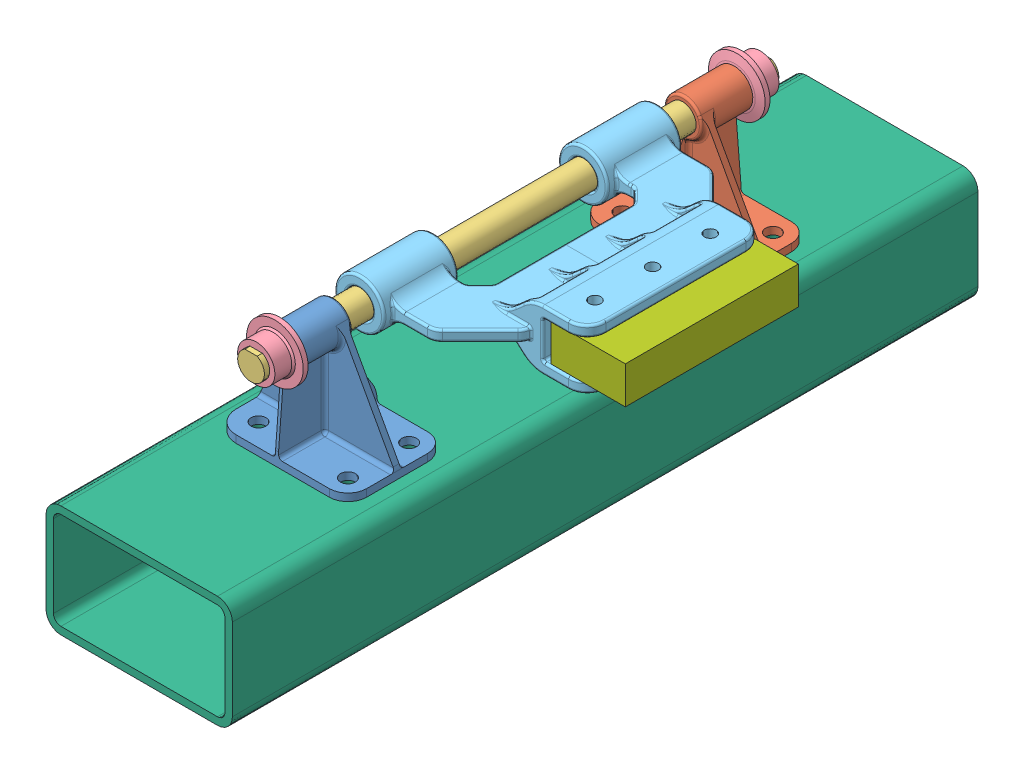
SolidWorks assembly Supporto pannelli.sldasm, configuration Default (file format 11000). Lengths in mm.
Overall size (393 324.4 1000).
8 component instances, 7 part files, 0 mates.
Components (placement in the parent):
- Bearing_bracket3_3(final)-1: Bearing_bracket3_3(final).sldprt [Default] at origin size (180 159.4 132)
- Bearing_bracket3_3(MirrorDefault1)-1: Bearing_bracket3_3(MirrorDefault1).sldprt [Default] at (0 0 -480) size (180 159.4 132)
- Crossbar-1: Crossbar.sldprt [Default] at (129.3971 164.3971 -240) x (0 -1 0) z (0 0 -1) size (36 36 690)
- collar-1: collar.sldprt [Default] at (-5 134.3971 63) x (0 -1 0) z (0 0 1) size (76 76 35)
- collar-2: collar.sldprt [Default] at (-5 134.3971 -543) x (0 -1 0) z (0 0 -1) size (76 76 35)
- hinge_mount-1: hinge_mount.sldprt [Default] at (-5 134.3971 -240) x (0 0 1) z (0 -1 0) size (400 258 80)
- cross_beam-1: cross_beam.sldprt [Default] at (0 -75 -240) x (0 0 -1) z (0 1 0) size (1000 250 150)
- Panel-1: Panel.sldprt [Default] at (-5 109.3971 -240) x (0 0 -1) z (0 1 0) size (232 100 50)
